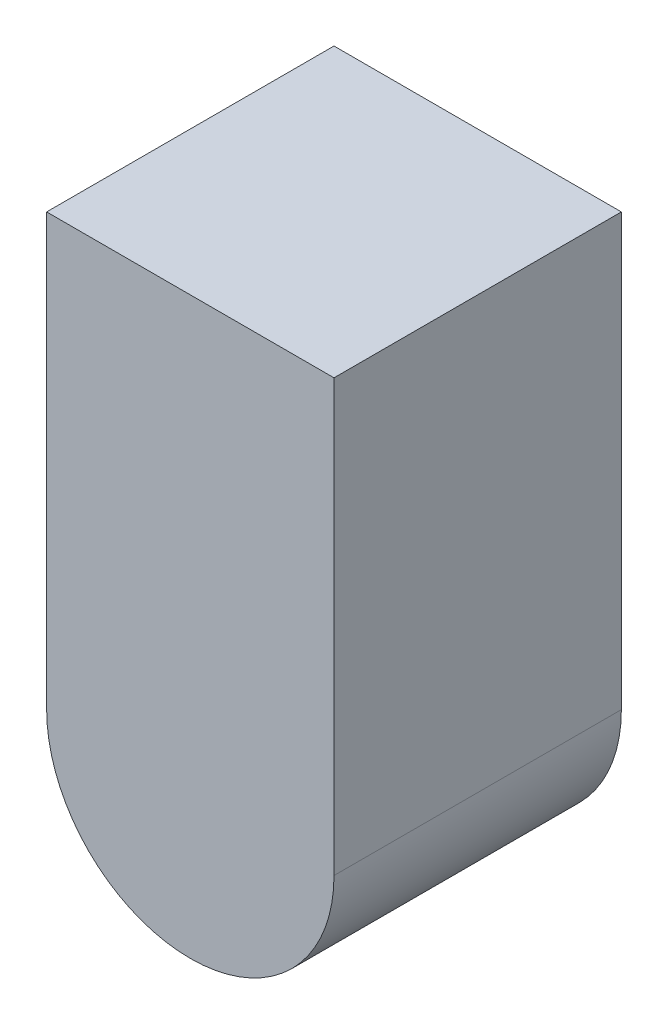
ISO-10303-21;
HEADER;
FILE_DESCRIPTION(('STEP AP214'),'2;1');
FILE_NAME('part.step','',(''),(''),'','','');
FILE_SCHEMA(('AUTOMOTIVE_DESIGN { 1 0 10303 214 1 1 1 1 }'));
ENDSEC;
DATA;
#1=APPLICATION_CONTEXT('core data for automotive mechanical design processes');
#2=APPLICATION_PROTOCOL_DEFINITION('international standard','automotive_design',2000,#1);
#3=PRODUCT_CONTEXT('',#1,'mechanical');
#4=PRODUCT('Part','Part','',(#3));
#5=PRODUCT_RELATED_PRODUCT_CATEGORY('part','',(#4));
#6=PRODUCT_DEFINITION_FORMATION('','',#4);
#7=PRODUCT_DEFINITION_CONTEXT('part definition',#1,'design');
#8=PRODUCT_DEFINITION('design','',#6,#7);
#9=PRODUCT_DEFINITION_SHAPE('','',#8);
#10=(LENGTH_UNIT() NAMED_UNIT(*) SI_UNIT(.MILLI.,.METRE.));
#11=(NAMED_UNIT(*) PLANE_ANGLE_UNIT() SI_UNIT($,.RADIAN.));
#12=(NAMED_UNIT(*) SI_UNIT($,.STERADIAN.) SOLID_ANGLE_UNIT());
#13=UNCERTAINTY_MEASURE_WITH_UNIT(LENGTH_MEASURE(1.E-05),#10,'distance_accuracy_value','');
#14=(GEOMETRIC_REPRESENTATION_CONTEXT(3) GLOBAL_UNCERTAINTY_ASSIGNED_CONTEXT((#13)) GLOBAL_UNIT_ASSIGNED_CONTEXT((#10,
#11,#12)) REPRESENTATION_CONTEXT('',''));
#15=CARTESIAN_POINT('',(0.,0.,0.));
#16=DIRECTION('',(0.,0.,1.));
#17=DIRECTION('',(1.,0.,0.));
#18=AXIS2_PLACEMENT_3D('',#15,#16,#17);
#19=CARTESIAN_POINT('',(0.,0.,0.));
#20=DIRECTION('',(0.,0.,1.));
#21=DIRECTION('',(1.,0.,0.));
#22=AXIS2_PLACEMENT_3D('',#19,#20,#21);
#23=PLANE('',#22);
#24=CARTESIAN_POINT('',(0.,-2.99999999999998,0.));
#25=DIRECTION('',(0.,0.,-1.));
#26=DIRECTION('',(-1.,0.,0.));
#27=AXIS2_PLACEMENT_3D('',#24,#25,#26);
#28=CIRCLE('',#27,3.);
#29=CARTESIAN_POINT('',(-3.00000000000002,-2.99999999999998,0.));
#30=VERTEX_POINT('',#29);
#31=CARTESIAN_POINT('',(2.99999999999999,-2.99999999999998,0.));
#32=VERTEX_POINT('',#31);
#33=EDGE_CURVE('E20',#30,#32,#28,.F.);
#34=ORIENTED_EDGE('',*,*,#33,.F.);
#35=DIRECTION('',(0.,1.,0.));
#36=VECTOR('',#35,1.);
#37=CARTESIAN_POINT('',(-3.00000000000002,6.00000000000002,0.));
#38=LINE('',#37,#36);
#39=CARTESIAN_POINT('',(-3.00000000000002,6.00000000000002,0.));
#40=VERTEX_POINT('',#39);
#41=EDGE_CURVE('E81',#30,#40,#38,.T.);
#42=ORIENTED_EDGE('',*,*,#41,.T.);
#43=DIRECTION('',(1.,0.,0.));
#44=VECTOR('',#43,1.);
#45=CARTESIAN_POINT('',(-3.00000000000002,6.00000000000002,0.));
#46=LINE('',#45,#44);
#47=CARTESIAN_POINT('',(2.99999999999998,6.00000000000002,0.));
#48=VERTEX_POINT('',#47);
#49=EDGE_CURVE('E59',#40,#48,#46,.T.);
#50=ORIENTED_EDGE('',*,*,#49,.T.);
#51=DIRECTION('',(0.,-1.,0.));
#52=VECTOR('',#51,1.);
#53=CARTESIAN_POINT('',(2.99999999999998,6.00000000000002,0.));
#54=LINE('',#53,#52);
#55=EDGE_CURVE('E55',#48,#32,#54,.T.);
#56=ORIENTED_EDGE('',*,*,#55,.T.);
#57=EDGE_LOOP('',(#34,#42,#50,#56));
#58=FACE_BOUND('',#57,.T.);
#59=ADVANCED_FACE('F17',(#58),#23,.F.);
#60=CARTESIAN_POINT('',(0.,-2.99999999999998,6.));
#61=DIRECTION('',(0.,0.,-1.));
#62=DIRECTION('',(-1.,0.,0.));
#63=AXIS2_PLACEMENT_3D('',#60,#61,#62);
#64=CYLINDRICAL_SURFACE('',#63,3.);
#65=ORIENTED_EDGE('',*,*,#33,.T.);
#66=DIRECTION('',(0.,0.,1.));
#67=VECTOR('',#66,1.);
#68=CARTESIAN_POINT('',(2.99999999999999,-2.99999999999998,6.));
#69=LINE('',#68,#67);
#70=CARTESIAN_POINT('',(2.99999999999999,-2.99999999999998,6.));
#71=VERTEX_POINT('',#70);
#72=EDGE_CURVE('E63',#32,#71,#69,.T.);
#73=ORIENTED_EDGE('',*,*,#72,.T.);
#74=CARTESIAN_POINT('',(0.,-2.99999999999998,6.));
#75=DIRECTION('',(0.,0.,-1.));
#76=DIRECTION('',(-1.,0.,0.));
#77=AXIS2_PLACEMENT_3D('',#74,#75,#76);
#78=CIRCLE('',#77,3.);
#79=CARTESIAN_POINT('',(-3.00000000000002,-2.99999999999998,6.));
#80=VERTEX_POINT('',#79);
#81=EDGE_CURVE('E83',#80,#71,#78,.F.);
#82=ORIENTED_EDGE('',*,*,#81,.F.);
#83=DIRECTION('',(0.,0.,1.));
#84=VECTOR('',#83,1.);
#85=CARTESIAN_POINT('',(-3.00000000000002,-2.99999999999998,6.));
#86=LINE('',#85,#84);
#87=EDGE_CURVE('E70',#80,#30,#86,.F.);
#88=ORIENTED_EDGE('',*,*,#87,.T.);
#89=EDGE_LOOP('',(#65,#73,#82,#88));
#90=FACE_BOUND('',#89,.T.);
#91=ADVANCED_FACE('F67',(#90),#64,.T.);
#92=CARTESIAN_POINT('',(2.99999999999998,6.00000000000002,6.));
#93=DIRECTION('',(-1.,0.,0.));
#94=DIRECTION('',(0.,-1.,0.));
#95=AXIS2_PLACEMENT_3D('',#92,#93,#94);
#96=PLANE('',#95);
#97=ORIENTED_EDGE('',*,*,#72,.F.);
#98=ORIENTED_EDGE('',*,*,#55,.F.);
#99=DIRECTION('',(0.,0.,-1.));
#100=VECTOR('',#99,1.);
#101=CARTESIAN_POINT('',(2.99999999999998,6.00000000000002,6.));
#102=LINE('',#101,#100);
#103=CARTESIAN_POINT('',(2.99999999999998,6.00000000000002,6.));
#104=VERTEX_POINT('',#103);
#105=EDGE_CURVE('E75',#48,#104,#102,.F.);
#106=ORIENTED_EDGE('',*,*,#105,.T.);
#107=DIRECTION('',(0.,1.,0.));
#108=VECTOR('',#107,1.);
#109=CARTESIAN_POINT('',(2.99999999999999,0.,6.));
#110=LINE('',#109,#108);
#111=EDGE_CURVE('E74',#71,#104,#110,.T.);
#112=ORIENTED_EDGE('',*,*,#111,.F.);
#113=EDGE_LOOP('',(#97,#98,#106,#112));
#114=FACE_BOUND('',#113,.T.);
#115=ADVANCED_FACE('F72',(#114),#96,.F.);
#116=CARTESIAN_POINT('',(-3.00000000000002,6.00000000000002,6.));
#117=DIRECTION('',(0.,-1.,0.));
#118=DIRECTION('',(0.,0.,-1.));
#119=AXIS2_PLACEMENT_3D('',#116,#117,#118);
#120=PLANE('',#119);
#121=DIRECTION('',(0.,0.,1.));
#122=VECTOR('',#121,1.);
#123=CARTESIAN_POINT('',(-3.00000000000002,6.00000000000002,6.));
#124=LINE('',#123,#122);
#125=CARTESIAN_POINT('',(-3.00000000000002,6.00000000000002,6.));
#126=VERTEX_POINT('',#125);
#127=EDGE_CURVE('E35',#40,#126,#124,.T.);
#128=ORIENTED_EDGE('',*,*,#127,.T.);
#129=DIRECTION('',(1.,0.,0.));
#130=VECTOR('',#129,1.);
#131=CARTESIAN_POINT('',(0.,6.00000000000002,6.));
#132=LINE('',#131,#130);
#133=EDGE_CURVE('E26',#104,#126,#132,.F.);
#134=ORIENTED_EDGE('',*,*,#133,.F.);
#135=ORIENTED_EDGE('',*,*,#105,.F.);
#136=ORIENTED_EDGE('',*,*,#49,.F.);
#137=EDGE_LOOP('',(#128,#134,#135,#136));
#138=FACE_BOUND('',#137,.T.);
#139=ADVANCED_FACE('F105',(#138),#120,.F.);
#140=CARTESIAN_POINT('',(-3.00000000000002,6.00000000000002,6.));
#141=DIRECTION('',(1.,0.,0.));
#142=DIRECTION('',(0.,1.,0.));
#143=AXIS2_PLACEMENT_3D('',#140,#141,#142);
#144=PLANE('',#143);
#145=ORIENTED_EDGE('',*,*,#87,.F.);
#146=DIRECTION('',(0.,1.,0.));
#147=VECTOR('',#146,1.);
#148=CARTESIAN_POINT('',(-3.00000000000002,0.,6.));
#149=LINE('',#148,#147);
#150=EDGE_CURVE('E11',#126,#80,#149,.F.);
#151=ORIENTED_EDGE('',*,*,#150,.F.);
#152=ORIENTED_EDGE('',*,*,#127,.F.);
#153=ORIENTED_EDGE('',*,*,#41,.F.);
#154=EDGE_LOOP('',(#145,#151,#152,#153));
#155=FACE_BOUND('',#154,.T.);
#156=ADVANCED_FACE('F107',(#155),#144,.F.);
#157=CARTESIAN_POINT('',(0.,0.,6.));
#158=DIRECTION('',(0.,0.,1.));
#159=DIRECTION('',(1.,0.,0.));
#160=AXIS2_PLACEMENT_3D('',#157,#158,#159);
#161=PLANE('',#160);
#162=ORIENTED_EDGE('',*,*,#133,.T.);
#163=ORIENTED_EDGE('',*,*,#150,.T.);
#164=ORIENTED_EDGE('',*,*,#81,.T.);
#165=ORIENTED_EDGE('',*,*,#111,.T.);
#166=EDGE_LOOP('',(#162,#163,#164,#165));
#167=FACE_BOUND('',#166,.T.);
#168=ADVANCED_FACE('F104',(#167),#161,.T.);
#169=CLOSED_SHELL('',(#59,#91,#115,#139,#156,#168));
#170=MANIFOLD_SOLID_BREP('B1',#169);
#171=ADVANCED_BREP_SHAPE_REPRESENTATION('',(#18,#170),#14);
#172=SHAPE_DEFINITION_REPRESENTATION(#9,#171);
ENDSEC;
END-ISO-10303-21;
